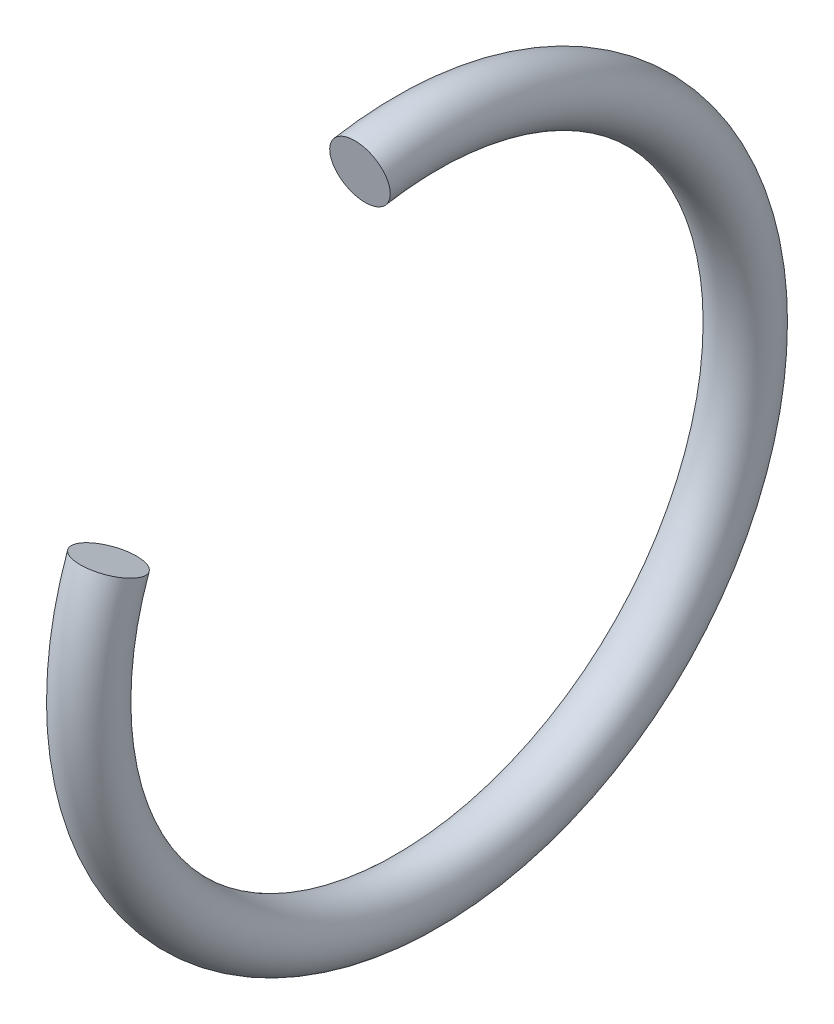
from build123d import *
from build123d.topology import SkipClean

# Parameters (mm, degrees)
ESQUISSE1_R                     = 0.5
BASE_R_VOLUTION_ANGLE           = 10
BASE_R_VOLUTION_OTHER_WAY_ANGLE = 290


with BuildPart() as part:
    # Esquisse1 → Base-R_volution (revolve)
    with BuildSketch(Plane.XY):
        with Locations((54.4, 5.5)):
            Circle(ESQUISSE1_R)
    revolve(axis=Axis((45.2, 0, 0), (1, 0, 0)), revolution_arc=BASE_R_VOLUTION_ANGLE)

    # Esquisse1 → Base-R_volution other way (revolve)
    with SkipClean():  # the faces are left unmerged after this step: merging them gives an invalid solid
        with BuildSketch(Plane.XY):
            with Locations((54.4, 5.5)):
                Circle(ESQUISSE1_R)
        revolve(axis=Axis((45.2, 0, 0), (-1, 0, 0)), revolution_arc=BASE_R_VOLUTION_OTHER_WAY_ANGLE)


solid = part.part
